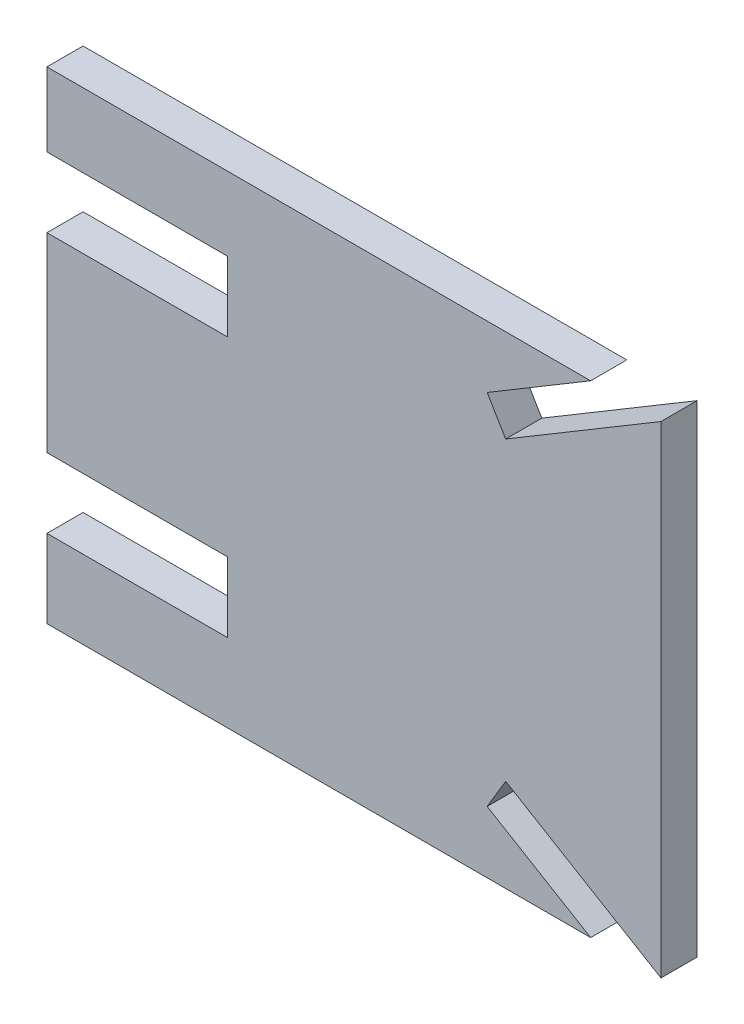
from build123d import *

# Parameters (mm, degrees)
SALIENTE_EXTRUIR1_DEPTH = 3


with BuildPart() as part:
    # Croquis1 → Saliente-Extruir1 (new body)
    with BuildSketch(Plane.XY):
        Polygon((-22.552688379, 13.7), (-7.552688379, 13.7), (-7.552688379, 7.9), (-22.552688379, 7.9), (-22.552688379, -7.9), (-7.552688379, -7.9), (-7.552688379, -13.7), (-22.552688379, -13.7), (-22.552688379, -20.188072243), (22.552688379, -20.188072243), (13.968274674, -15.058955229), (15.507009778, -12.483631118), (28.383630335, -20.177306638), (28.383630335, 19.800773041), (15.507009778, 12.10709752), (13.968274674, 14.682421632), (22.552688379, 19.811538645), (-22.552688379, 19.811538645), align=None)
    extrude(amount=SALIENTE_EXTRUIR1_DEPTH)


solid = part.part
